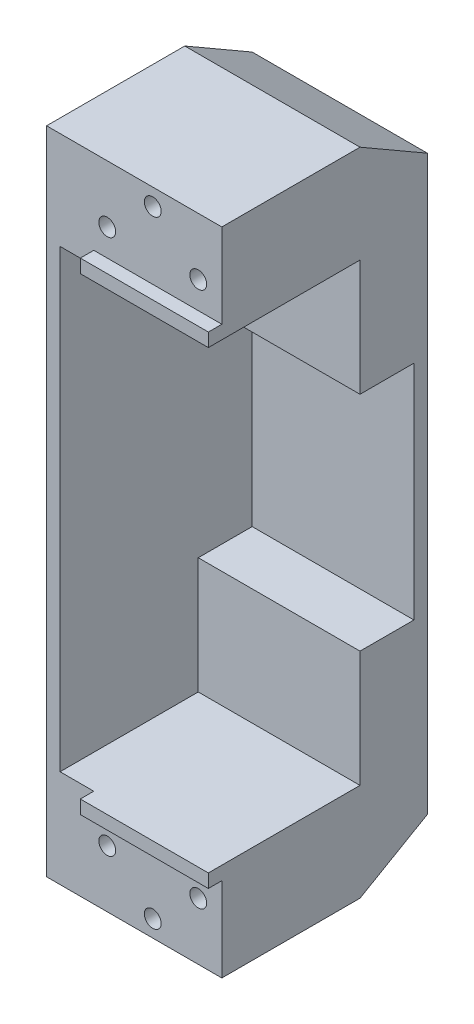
ISO-10303-21;
HEADER;
FILE_DESCRIPTION(('STEP AP214'),'2;1');
FILE_NAME('part.step','',(''),(''),'','','');
FILE_SCHEMA(('AUTOMOTIVE_DESIGN { 1 0 10303 214 1 1 1 1 }'));
ENDSEC;
DATA;
#1=APPLICATION_CONTEXT('core data for automotive mechanical design processes');
#2=APPLICATION_PROTOCOL_DEFINITION('international standard','automotive_design',2000,#1);
#3=PRODUCT_CONTEXT('',#1,'mechanical');
#4=PRODUCT('Part','Part','',(#3));
#5=PRODUCT_RELATED_PRODUCT_CATEGORY('part','',(#4));
#6=PRODUCT_DEFINITION_FORMATION('','',#4);
#7=PRODUCT_DEFINITION_CONTEXT('part definition',#1,'design');
#8=PRODUCT_DEFINITION('design','',#6,#7);
#9=PRODUCT_DEFINITION_SHAPE('','',#8);
#10=(LENGTH_UNIT() NAMED_UNIT(*) SI_UNIT(.MILLI.,.METRE.));
#11=(NAMED_UNIT(*) PLANE_ANGLE_UNIT() SI_UNIT($,.RADIAN.));
#12=(NAMED_UNIT(*) SI_UNIT($,.STERADIAN.) SOLID_ANGLE_UNIT());
#13=UNCERTAINTY_MEASURE_WITH_UNIT(LENGTH_MEASURE(1.E-05),#10,'distance_accuracy_value','');
#14=(GEOMETRIC_REPRESENTATION_CONTEXT(3) GLOBAL_UNCERTAINTY_ASSIGNED_CONTEXT((#13)) GLOBAL_UNIT_ASSIGNED_CONTEXT((#10,
#11,#12)) REPRESENTATION_CONTEXT('',''));
#15=CARTESIAN_POINT('',(0.,0.,0.));
#16=DIRECTION('',(0.,0.,1.));
#17=DIRECTION('',(1.,0.,0.));
#18=AXIS2_PLACEMENT_3D('',#15,#16,#17);
#19=CARTESIAN_POINT('',(0.,-164.,-57.));
#20=DIRECTION('',(0.,0.,-1.));
#21=DIRECTION('',(-1.,0.,0.));
#22=AXIS2_PLACEMENT_3D('',#19,#20,#21);
#23=PLANE('',#22);
#24=DIRECTION('',(-1.,0.,0.));
#25=VECTOR('',#24,1.);
#26=CARTESIAN_POINT('',(0.,-129.5,-57.));
#27=LINE('',#26,#25);
#28=CARTESIAN_POINT('',(0.,-129.5,-57.));
#29=VERTEX_POINT('',#28);
#30=CARTESIAN_POINT('',(-48.,-129.5,-57.));
#31=VERTEX_POINT('',#30);
#32=EDGE_CURVE('E223',#29,#31,#27,.T.);
#33=ORIENTED_EDGE('',*,*,#32,.F.);
#34=DIRECTION('',(0.,1.,0.));
#35=VECTOR('',#34,1.);
#36=CARTESIAN_POINT('',(0.,-164.,-57.));
#37=LINE('',#36,#35);
#38=CARTESIAN_POINT('',(0.,-63.5,-57.));
#39=VERTEX_POINT('',#38);
#40=EDGE_CURVE('E203',#29,#39,#37,.T.);
#41=ORIENTED_EDGE('',*,*,#40,.T.);
#42=DIRECTION('',(-1.,0.,0.));
#43=VECTOR('',#42,1.);
#44=CARTESIAN_POINT('',(0.,-63.5,-57.));
#45=LINE('',#44,#43);
#46=CARTESIAN_POINT('',(-48.,-63.5,-57.));
#47=VERTEX_POINT('',#46);
#48=EDGE_CURVE('E373',#39,#47,#45,.T.);
#49=ORIENTED_EDGE('',*,*,#48,.T.);
#50=DIRECTION('',(0.,1.,0.));
#51=VECTOR('',#50,1.);
#52=CARTESIAN_POINT('',(-48.,-164.,-57.));
#53=LINE('',#52,#51);
#54=EDGE_CURVE('E289',#31,#47,#53,.T.);
#55=ORIENTED_EDGE('',*,*,#54,.F.);
#56=EDGE_LOOP('',(#33,#41,#49,#55));
#57=FACE_BOUND('',#56,.T.);
#58=ADVANCED_FACE('F42',(#57),#23,.F.);
#59=CARTESIAN_POINT('',(0.,-29.,0.));
#60=DIRECTION('',(0.,-1.,0.));
#61=DIRECTION('',(0.,0.,-1.));
#62=AXIS2_PLACEMENT_3D('',#59,#60,#61);
#63=PLANE('',#62);
#64=DIRECTION('',(1.,0.,0.));
#65=VECTOR('',#64,1.);
#66=CARTESIAN_POINT('',(-52.,-29.,0.));
#67=LINE('',#66,#65);
#68=CARTESIAN_POINT('',(-48.,-29.,0.));
#69=VERTEX_POINT('',#68);
#70=CARTESIAN_POINT('',(-38.,-29.,0.));
#71=VERTEX_POINT('',#70);
#72=EDGE_CURVE('E352',#69,#71,#67,.T.);
#73=ORIENTED_EDGE('',*,*,#72,.F.);
#74=DIRECTION('',(0.,0.,1.));
#75=VECTOR('',#74,1.);
#76=CARTESIAN_POINT('',(-48.,-29.,-57.));
#77=LINE('',#76,#75);
#78=CARTESIAN_POINT('',(-48.,-29.,-41.));
#79=VERTEX_POINT('',#78);
#80=EDGE_CURVE('E281',#79,#69,#77,.T.);
#81=ORIENTED_EDGE('',*,*,#80,.F.);
#82=DIRECTION('',(-1.,0.,0.));
#83=VECTOR('',#82,1.);
#84=CARTESIAN_POINT('',(-52.,-29.,-41.));
#85=LINE('',#84,#83);
#86=CARTESIAN_POINT('',(0.,-29.,-41.));
#87=VERTEX_POINT('',#86);
#88=EDGE_CURVE('E295',#87,#79,#85,.T.);
#89=ORIENTED_EDGE('',*,*,#88,.F.);
#90=DIRECTION('',(0.,0.,-1.));
#91=VECTOR('',#90,1.);
#92=CARTESIAN_POINT('',(0.,-29.,0.));
#93=LINE('',#92,#91);
#94=CARTESIAN_POINT('',(0.,-29.,4.));
#95=VERTEX_POINT('',#94);
#96=EDGE_CURVE('E349',#95,#87,#93,.T.);
#97=ORIENTED_EDGE('',*,*,#96,.F.);
#98=DIRECTION('',(1.,0.,0.));
#99=VECTOR('',#98,1.);
#100=CARTESIAN_POINT('',(0.,-29.,4.));
#101=LINE('',#100,#99);
#102=CARTESIAN_POINT('',(-38.,-29.,4.));
#103=VERTEX_POINT('',#102);
#104=EDGE_CURVE('E332',#103,#95,#101,.T.);
#105=ORIENTED_EDGE('',*,*,#104,.F.);
#106=DIRECTION('',(0.,0.,-1.));
#107=VECTOR('',#106,1.);
#108=CARTESIAN_POINT('',(-38.,-29.,4.));
#109=LINE('',#108,#107);
#110=EDGE_CURVE('E335',#103,#71,#109,.T.);
#111=ORIENTED_EDGE('',*,*,#110,.T.);
#112=EDGE_LOOP('',(#73,#81,#89,#97,#105,#111));
#113=FACE_BOUND('',#112,.T.);
#114=ADVANCED_FACE('F466',(#113),#63,.T.);
#115=CARTESIAN_POINT('',(-52.,-63.5,-41.));
#116=DIRECTION('',(0.,0.,-1.));
#117=DIRECTION('',(-1.,0.,0.));
#118=AXIS2_PLACEMENT_3D('',#115,#116,#117);
#119=PLANE('',#118);
#120=DIRECTION('',(0.,1.,0.));
#121=VECTOR('',#120,1.);
#122=CARTESIAN_POINT('',(-48.,-63.5,-41.));
#123=LINE('',#122,#121);
#124=CARTESIAN_POINT('',(-48.,-63.5,-41.));
#125=VERTEX_POINT('',#124);
#126=EDGE_CURVE('E292',#125,#79,#123,.T.);
#127=ORIENTED_EDGE('',*,*,#126,.F.);
#128=DIRECTION('',(-1.,0.,0.));
#129=VECTOR('',#128,1.);
#130=CARTESIAN_POINT('',(-52.,-63.5,-41.));
#131=LINE('',#130,#129);
#132=CARTESIAN_POINT('',(0.,-63.5,-41.));
#133=VERTEX_POINT('',#132);
#134=EDGE_CURVE('E298',#133,#125,#131,.T.);
#135=ORIENTED_EDGE('',*,*,#134,.F.);
#136=DIRECTION('',(0.,1.,0.));
#137=VECTOR('',#136,1.);
#138=CARTESIAN_POINT('',(0.,-63.5,-41.));
#139=LINE('',#138,#137);
#140=EDGE_CURVE('E300',#133,#87,#139,.T.);
#141=ORIENTED_EDGE('',*,*,#140,.T.);
#142=ORIENTED_EDGE('',*,*,#88,.T.);
#143=EDGE_LOOP('',(#127,#135,#141,#142));
#144=FACE_BOUND('',#143,.T.);
#145=ADVANCED_FACE('F428',(#144),#119,.F.);
#146=CARTESIAN_POINT('',(0.,-63.5,0.));
#147=DIRECTION('',(0.,1.,0.));
#148=DIRECTION('',(0.,0.,1.));
#149=AXIS2_PLACEMENT_3D('',#146,#147,#148);
#150=PLANE('',#149);
#151=ORIENTED_EDGE('',*,*,#48,.F.);
#152=DIRECTION('',(0.,0.,1.));
#153=VECTOR('',#152,1.);
#154=CARTESIAN_POINT('',(0.,-63.5,-61.));
#155=LINE('',#154,#153);
#156=EDGE_CURVE('E296',#39,#133,#155,.T.);
#157=ORIENTED_EDGE('',*,*,#156,.T.);
#158=ORIENTED_EDGE('',*,*,#134,.T.);
#159=DIRECTION('',(0.,0.,1.));
#160=VECTOR('',#159,1.);
#161=CARTESIAN_POINT('',(-48.,-63.5,0.));
#162=LINE('',#161,#160);
#163=EDGE_CURVE('E364',#47,#125,#162,.T.);
#164=ORIENTED_EDGE('',*,*,#163,.F.);
#165=EDGE_LOOP('',(#151,#157,#158,#164));
#166=FACE_BOUND('',#165,.T.);
#167=ADVANCED_FACE('F432',(#166),#150,.F.);
#168=CARTESIAN_POINT('',(0.,-29.,0.));
#169=DIRECTION('',(1.,0.,0.));
#170=DIRECTION('',(0.,0.,-1.));
#171=AXIS2_PLACEMENT_3D('',#168,#169,#170);
#172=PLANE('',#171);
#173=DIRECTION('',(0.,0.,-1.));
#174=VECTOR('',#173,1.);
#175=CARTESIAN_POINT('',(0.,-193.,0.));
#176=LINE('',#175,#174);
#177=CARTESIAN_POINT('',(0.,-193.,0.));
#178=VERTEX_POINT('',#177);
#179=CARTESIAN_POINT('',(0.,-193.,-40.9999999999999));
#180=VERTEX_POINT('',#179);
#181=EDGE_CURVE('E267',#178,#180,#176,.T.);
#182=ORIENTED_EDGE('',*,*,#181,.T.);
#183=DIRECTION('',(0.,0.499999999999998,-0.86602540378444));
#184=VECTOR('',#183,1.);
#185=CARTESIAN_POINT('',(0.,-169.753520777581,-81.2640831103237));
#186=LINE('',#185,#184);
#187=CARTESIAN_POINT('',(0.,-181.452994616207,-61.));
#188=VERTEX_POINT('',#187);
#189=EDGE_CURVE('E11',#180,#188,#186,.T.);
#190=ORIENTED_EDGE('',*,*,#189,.T.);
#191=DIRECTION('',(0.,1.,0.));
#192=VECTOR('',#191,1.);
#193=CARTESIAN_POINT('',(0.,-29.,-61.));
#194=LINE('',#193,#192);
#195=CARTESIAN_POINT('',(0.,-11.5470053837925,-61.));
#196=VERTEX_POINT('',#195);
#197=EDGE_CURVE('E355',#188,#196,#194,.T.);
#198=ORIENTED_EDGE('',*,*,#197,.T.);
#199=DIRECTION('',(0.,0.499999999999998,0.86602540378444));
#200=VECTOR('',#199,1.);
#201=CARTESIAN_POINT('',(0.,10.5035207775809,-22.8073683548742));
#202=LINE('',#201,#200);
#203=CARTESIAN_POINT('',(0.,0.,-40.9999999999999));
#204=VERTEX_POINT('',#203);
#205=EDGE_CURVE('E385',#196,#204,#202,.T.);
#206=ORIENTED_EDGE('',*,*,#205,.T.);
#207=DIRECTION('',(0.,0.,-1.));
#208=VECTOR('',#207,1.);
#209=CARTESIAN_POINT('',(0.,0.,0.));
#210=LINE('',#209,#208);
#211=CARTESIAN_POINT('',(0.,0.,0.));
#212=VERTEX_POINT('',#211);
#213=EDGE_CURVE('E348',#212,#204,#210,.T.);
#214=ORIENTED_EDGE('',*,*,#213,.F.);
#215=DIRECTION('',(0.,1.,0.));
#216=VECTOR('',#215,1.);
#217=CARTESIAN_POINT('',(0.,-29.,0.));
#218=LINE('',#217,#216);
#219=CARTESIAN_POINT('',(0.,-25.,0.));
#220=VERTEX_POINT('',#219);
#221=EDGE_CURVE('E362',#220,#212,#218,.T.);
#222=ORIENTED_EDGE('',*,*,#221,.F.);
#223=DIRECTION('',(0.,0.,-1.));
#224=VECTOR('',#223,1.);
#225=CARTESIAN_POINT('',(0.,-25.,4.));
#226=LINE('',#225,#224);
#227=CARTESIAN_POINT('',(0.,-25.,4.));
#228=VERTEX_POINT('',#227);
#229=EDGE_CURVE('E345',#228,#220,#226,.T.);
#230=ORIENTED_EDGE('',*,*,#229,.F.);
#231=DIRECTION('',(0.,1.,0.));
#232=VECTOR('',#231,1.);
#233=CARTESIAN_POINT('',(0.,-29.,4.));
#234=LINE('',#233,#232);
#235=EDGE_CURVE('E324',#95,#228,#234,.T.);
#236=ORIENTED_EDGE('',*,*,#235,.F.);
#237=ORIENTED_EDGE('',*,*,#96,.T.);
#238=ORIENTED_EDGE('',*,*,#140,.F.);
#239=ORIENTED_EDGE('',*,*,#156,.F.);
#240=ORIENTED_EDGE('',*,*,#40,.F.);
#241=DIRECTION('',(0.,0.,1.));
#242=VECTOR('',#241,1.);
#243=CARTESIAN_POINT('',(0.,-129.5,-61.));
#244=LINE('',#243,#242);
#245=CARTESIAN_POINT('',(0.,-129.5,-41.));
#246=VERTEX_POINT('',#245);
#247=EDGE_CURVE('E197',#29,#246,#244,.T.);
#248=ORIENTED_EDGE('',*,*,#247,.T.);
#249=DIRECTION('',(0.,-1.,0.));
#250=VECTOR('',#249,1.);
#251=CARTESIAN_POINT('',(0.,-129.5,-41.));
#252=LINE('',#251,#250);
#253=CARTESIAN_POINT('',(0.,-164.,-41.));
#254=VERTEX_POINT('',#253);
#255=EDGE_CURVE('E200',#246,#254,#252,.T.);
#256=ORIENTED_EDGE('',*,*,#255,.T.);
#257=DIRECTION('',(0.,0.,-1.));
#258=VECTOR('',#257,1.);
#259=CARTESIAN_POINT('',(0.,-164.,0.));
#260=LINE('',#259,#258);
#261=CARTESIAN_POINT('',(0.,-164.,4.));
#262=VERTEX_POINT('',#261);
#263=EDGE_CURVE('E268',#262,#254,#260,.T.);
#264=ORIENTED_EDGE('',*,*,#263,.F.);
#265=DIRECTION('',(0.,-1.,0.));
#266=VECTOR('',#265,1.);
#267=CARTESIAN_POINT('',(0.,-164.,4.));
#268=LINE('',#267,#266);
#269=CARTESIAN_POINT('',(0.,-168.,4.));
#270=VERTEX_POINT('',#269);
#271=EDGE_CURVE('E244',#262,#270,#268,.T.);
#272=ORIENTED_EDGE('',*,*,#271,.T.);
#273=DIRECTION('',(0.,0.,-1.));
#274=VECTOR('',#273,1.);
#275=CARTESIAN_POINT('',(0.,-168.,4.));
#276=LINE('',#275,#274);
#277=CARTESIAN_POINT('',(0.,-168.,0.));
#278=VERTEX_POINT('',#277);
#279=EDGE_CURVE('E257',#270,#278,#276,.T.);
#280=ORIENTED_EDGE('',*,*,#279,.T.);
#281=DIRECTION('',(0.,-1.,0.));
#282=VECTOR('',#281,1.);
#283=CARTESIAN_POINT('',(0.,-164.,0.));
#284=LINE('',#283,#282);
#285=EDGE_CURVE('E274',#278,#178,#284,.T.);
#286=ORIENTED_EDGE('',*,*,#285,.T.);
#287=EDGE_LOOP('',(#182,#190,#198,#206,#214,#222,#230,#236,#237,#238,#239,#240,#248,#256,#264,
#272,#280,#286));
#288=FACE_BOUND('',#287,.T.);
#289=ADVANCED_FACE('F199',(#288),#172,.T.);
#290=CARTESIAN_POINT('',(-52.,-29.,0.));
#291=DIRECTION('',(0.,0.,1.));
#292=DIRECTION('',(1.,0.,0.));
#293=AXIS2_PLACEMENT_3D('',#290,#291,#292);
#294=PLANE('',#293);
#295=CARTESIAN_POINT('',(-34.,-176.,0.));
#296=DIRECTION('',(0.,0.,1.));
#297=DIRECTION('',(1.,0.,0.));
#298=AXIS2_PLACEMENT_3D('',#295,#296,#297);
#299=CIRCLE('',#298,2.49999999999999);
#300=CARTESIAN_POINT('',(-31.5,-176.,0.));
#301=VERTEX_POINT('',#300);
#302=EDGE_CURVE('E225',#301,#301,#299,.T.);
#303=ORIENTED_EDGE('',*,*,#302,.F.);
#304=EDGE_LOOP('',(#303));
#305=FACE_BOUND('',#304,.T.);
#306=CARTESIAN_POINT('',(-7.,-176.,0.));
#307=DIRECTION('',(0.,0.,1.));
#308=DIRECTION('',(1.,0.,0.));
#309=AXIS2_PLACEMENT_3D('',#306,#307,#308);
#310=CIRCLE('',#309,2.49999999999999);
#311=CARTESIAN_POINT('',(-4.50000000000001,-176.,0.));
#312=VERTEX_POINT('',#311);
#313=EDGE_CURVE('E231',#312,#312,#310,.T.);
#314=ORIENTED_EDGE('',*,*,#313,.F.);
#315=EDGE_LOOP('',(#314));
#316=FACE_BOUND('',#315,.T.);
#317=CARTESIAN_POINT('',(-20.5,-188.,0.));
#318=DIRECTION('',(0.,0.,1.));
#319=DIRECTION('',(1.,0.,0.));
#320=AXIS2_PLACEMENT_3D('',#317,#318,#319);
#321=CIRCLE('',#320,2.49999999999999);
#322=CARTESIAN_POINT('',(-18.,-188.,0.));
#323=VERTEX_POINT('',#322);
#324=EDGE_CURVE('E237',#323,#323,#321,.T.);
#325=ORIENTED_EDGE('',*,*,#324,.F.);
#326=EDGE_LOOP('',(#325));
#327=FACE_BOUND('',#326,.T.);
#328=DIRECTION('',(0.,1.,0.));
#329=VECTOR('',#328,1.);
#330=CARTESIAN_POINT('',(-38.,-164.,0.));
#331=LINE('',#330,#329);
#332=CARTESIAN_POINT('',(-38.,-168.,0.));
#333=VERTEX_POINT('',#332);
#334=CARTESIAN_POINT('',(-38.,-164.,0.));
#335=VERTEX_POINT('',#334);
#336=EDGE_CURVE('E243',#333,#335,#331,.T.);
#337=ORIENTED_EDGE('',*,*,#336,.T.);
#338=DIRECTION('',(1.,0.,0.));
#339=VECTOR('',#338,1.);
#340=CARTESIAN_POINT('',(-52.,-164.,0.));
#341=LINE('',#340,#339);
#342=CARTESIAN_POINT('',(-48.,-164.,0.));
#343=VERTEX_POINT('',#342);
#344=EDGE_CURVE('E270',#343,#335,#341,.T.);
#345=ORIENTED_EDGE('',*,*,#344,.F.);
#346=DIRECTION('',(0.,1.,0.));
#347=VECTOR('',#346,1.);
#348=CARTESIAN_POINT('',(-48.,-164.,0.));
#349=LINE('',#348,#347);
#350=EDGE_CURVE('E284',#343,#69,#349,.T.);
#351=ORIENTED_EDGE('',*,*,#350,.T.);
#352=ORIENTED_EDGE('',*,*,#72,.T.);
#353=DIRECTION('',(0.,-1.,0.));
#354=VECTOR('',#353,1.);
#355=CARTESIAN_POINT('',(-38.,-29.,0.));
#356=LINE('',#355,#354);
#357=CARTESIAN_POINT('',(-38.,-25.,0.));
#358=VERTEX_POINT('',#357);
#359=EDGE_CURVE('E328',#358,#71,#356,.T.);
#360=ORIENTED_EDGE('',*,*,#359,.F.);
#361=DIRECTION('',(-1.,0.,0.));
#362=VECTOR('',#361,1.);
#363=CARTESIAN_POINT('',(0.,-25.,0.));
#364=LINE('',#363,#362);
#365=EDGE_CURVE('E323',#220,#358,#364,.T.);
#366=ORIENTED_EDGE('',*,*,#365,.F.);
#367=ORIENTED_EDGE('',*,*,#221,.T.);
#368=DIRECTION('',(1.,0.,0.));
#369=VECTOR('',#368,1.);
#370=CARTESIAN_POINT('',(-52.,0.,0.));
#371=LINE('',#370,#369);
#372=CARTESIAN_POINT('',(-52.,0.,0.));
#373=VERTEX_POINT('',#372);
#374=EDGE_CURVE('E353',#373,#212,#371,.T.);
#375=ORIENTED_EDGE('',*,*,#374,.F.);
#376=DIRECTION('',(0.,1.,0.));
#377=VECTOR('',#376,1.);
#378=CARTESIAN_POINT('',(-52.,-29.,0.));
#379=LINE('',#378,#377);
#380=CARTESIAN_POINT('',(-52.,-193.,0.));
#381=VERTEX_POINT('',#380);
#382=EDGE_CURVE('E365',#381,#373,#379,.T.);
#383=ORIENTED_EDGE('',*,*,#382,.F.);
#384=DIRECTION('',(1.,0.,0.));
#385=VECTOR('',#384,1.);
#386=CARTESIAN_POINT('',(-52.,-193.,0.));
#387=LINE('',#386,#385);
#388=EDGE_CURVE('E276',#381,#178,#387,.T.);
#389=ORIENTED_EDGE('',*,*,#388,.T.);
#390=ORIENTED_EDGE('',*,*,#285,.F.);
#391=DIRECTION('',(-1.,0.,0.));
#392=VECTOR('',#391,1.);
#393=CARTESIAN_POINT('',(0.,-168.,0.));
#394=LINE('',#393,#392);
#395=EDGE_CURVE('E248',#278,#333,#394,.T.);
#396=ORIENTED_EDGE('',*,*,#395,.T.);
#397=EDGE_LOOP('',(#337,#345,#351,#352,#360,#366,#367,#375,#383,#389,#390,#396));
#398=FACE_BOUND('',#397,.T.);
#399=CARTESIAN_POINT('',(-34.,-17.,0.));
#400=DIRECTION('',(0.,0.,1.));
#401=DIRECTION('',(1.,0.,0.));
#402=AXIS2_PLACEMENT_3D('',#399,#400,#401);
#403=CIRCLE('',#402,2.49999999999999);
#404=CARTESIAN_POINT('',(-31.5,-17.,0.));
#405=VERTEX_POINT('',#404);
#406=EDGE_CURVE('E305',#405,#405,#403,.T.);
#407=ORIENTED_EDGE('',*,*,#406,.F.);
#408=EDGE_LOOP('',(#407));
#409=FACE_BOUND('',#408,.T.);
#410=CARTESIAN_POINT('',(-7.,-17.,0.));
#411=DIRECTION('',(0.,0.,1.));
#412=DIRECTION('',(1.,0.,0.));
#413=AXIS2_PLACEMENT_3D('',#410,#411,#412);
#414=CIRCLE('',#413,2.49999999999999);
#415=CARTESIAN_POINT('',(-4.50000000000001,-17.,0.));
#416=VERTEX_POINT('',#415);
#417=EDGE_CURVE('E311',#416,#416,#414,.T.);
#418=ORIENTED_EDGE('',*,*,#417,.F.);
#419=EDGE_LOOP('',(#418));
#420=FACE_BOUND('',#419,.T.);
#421=CARTESIAN_POINT('',(-20.5,-5.,0.));
#422=DIRECTION('',(0.,0.,1.));
#423=DIRECTION('',(1.,0.,0.));
#424=AXIS2_PLACEMENT_3D('',#421,#422,#423);
#425=CIRCLE('',#424,2.49999999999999);
#426=CARTESIAN_POINT('',(-18.,-5.,0.));
#427=VERTEX_POINT('',#426);
#428=EDGE_CURVE('E317',#427,#427,#425,.T.);
#429=ORIENTED_EDGE('',*,*,#428,.F.);
#430=EDGE_LOOP('',(#429));
#431=FACE_BOUND('',#430,.T.);
#432=ADVANCED_FACE('F411',(#305,#316,#327,#398,#409,#420,#431),#294,.T.);
#433=CARTESIAN_POINT('',(-52.,-29.,0.));
#434=DIRECTION('',(-1.,0.,0.));
#435=DIRECTION('',(0.,0.,1.));
#436=AXIS2_PLACEMENT_3D('',#433,#434,#435);
#437=PLANE('',#436);
#438=DIRECTION('',(0.,1.,0.));
#439=VECTOR('',#438,1.);
#440=CARTESIAN_POINT('',(-52.,-29.,-61.));
#441=LINE('',#440,#439);
#442=CARTESIAN_POINT('',(-52.,-181.452994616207,-61.));
#443=VERTEX_POINT('',#442);
#444=CARTESIAN_POINT('',(-52.,-11.5470053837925,-61.));
#445=VERTEX_POINT('',#444);
#446=EDGE_CURVE('E368',#443,#445,#441,.T.);
#447=ORIENTED_EDGE('',*,*,#446,.F.);
#448=DIRECTION('',(0.,-0.499999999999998,0.86602540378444));
#449=VECTOR('',#448,1.);
#450=CARTESIAN_POINT('',(-52.,-169.753520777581,-81.2640831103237));
#451=LINE('',#450,#449);
#452=CARTESIAN_POINT('',(-52.,-193.,-40.9999999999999));
#453=VERTEX_POINT('',#452);
#454=EDGE_CURVE('E64',#443,#453,#451,.T.);
#455=ORIENTED_EDGE('',*,*,#454,.T.);
#456=DIRECTION('',(0.,0.,1.));
#457=VECTOR('',#456,1.);
#458=CARTESIAN_POINT('',(-52.,-193.,0.));
#459=LINE('',#458,#457);
#460=EDGE_CURVE('E271',#453,#381,#459,.T.);
#461=ORIENTED_EDGE('',*,*,#460,.T.);
#462=ORIENTED_EDGE('',*,*,#382,.T.);
#463=DIRECTION('',(0.,0.,1.));
#464=VECTOR('',#463,1.);
#465=CARTESIAN_POINT('',(-52.,0.,0.));
#466=LINE('',#465,#464);
#467=CARTESIAN_POINT('',(-52.,0.,-40.9999999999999));
#468=VERTEX_POINT('',#467);
#469=EDGE_CURVE('E358',#468,#373,#466,.T.);
#470=ORIENTED_EDGE('',*,*,#469,.F.);
#471=DIRECTION('',(0.,-0.499999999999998,-0.86602540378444));
#472=VECTOR('',#471,1.);
#473=CARTESIAN_POINT('',(-52.,10.5035207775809,-22.8073683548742));
#474=LINE('',#473,#472);
#475=EDGE_CURVE('E379',#468,#445,#474,.T.);
#476=ORIENTED_EDGE('',*,*,#475,.T.);
#477=EDGE_LOOP('',(#447,#455,#461,#462,#470,#476));
#478=FACE_BOUND('',#477,.T.);
#479=ADVANCED_FACE('F397',(#478),#437,.T.);
#480=CARTESIAN_POINT('',(-52.,-29.,-61.));
#481=DIRECTION('',(0.,0.,-1.));
#482=DIRECTION('',(-1.,0.,0.));
#483=AXIS2_PLACEMENT_3D('',#480,#481,#482);
#484=PLANE('',#483);
#485=ORIENTED_EDGE('',*,*,#197,.F.);
#486=DIRECTION('',(-1.,0.,0.));
#487=VECTOR('',#486,1.);
#488=CARTESIAN_POINT('',(-52.,-181.452994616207,-61.));
#489=LINE('',#488,#487);
#490=EDGE_CURVE('E388',#188,#443,#489,.T.);
#491=ORIENTED_EDGE('',*,*,#490,.T.);
#492=ORIENTED_EDGE('',*,*,#446,.T.);
#493=DIRECTION('',(1.,0.,0.));
#494=VECTOR('',#493,1.);
#495=CARTESIAN_POINT('',(0.,-11.5470053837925,-61.));
#496=LINE('',#495,#494);
#497=EDGE_CURVE('E382',#445,#196,#496,.T.);
#498=ORIENTED_EDGE('',*,*,#497,.T.);
#499=EDGE_LOOP('',(#485,#491,#492,#498));
#500=FACE_BOUND('',#499,.T.);
#501=ADVANCED_FACE('F394',(#500),#484,.T.);
#502=CARTESIAN_POINT('',(0.,0.,0.));
#503=DIRECTION('',(0.,-1.,0.));
#504=DIRECTION('',(0.,0.,-1.));
#505=AXIS2_PLACEMENT_3D('',#502,#503,#504);
#506=PLANE('',#505);
#507=ORIENTED_EDGE('',*,*,#213,.T.);
#508=DIRECTION('',(-1.,0.,0.));
#509=VECTOR('',#508,1.);
#510=CARTESIAN_POINT('',(-52.,0.,-40.9999999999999));
#511=LINE('',#510,#509);
#512=EDGE_CURVE('E376',#204,#468,#511,.T.);
#513=ORIENTED_EDGE('',*,*,#512,.T.);
#514=ORIENTED_EDGE('',*,*,#469,.T.);
#515=ORIENTED_EDGE('',*,*,#374,.T.);
#516=EDGE_LOOP('',(#507,#513,#514,#515));
#517=FACE_BOUND('',#516,.T.);
#518=ADVANCED_FACE('F407',(#517),#506,.F.);
#519=CARTESIAN_POINT('',(0.,-25.,4.));
#520=DIRECTION('',(0.,-1.,0.));
#521=DIRECTION('',(1.,0.,0.));
#522=AXIS2_PLACEMENT_3D('',#519,#520,#521);
#523=PLANE('',#522);
#524=ORIENTED_EDGE('',*,*,#365,.T.);
#525=DIRECTION('',(0.,0.,-1.));
#526=VECTOR('',#525,1.);
#527=CARTESIAN_POINT('',(-38.,-25.,4.));
#528=LINE('',#527,#526);
#529=CARTESIAN_POINT('',(-38.,-25.,4.));
#530=VERTEX_POINT('',#529);
#531=EDGE_CURVE('E342',#530,#358,#528,.T.);
#532=ORIENTED_EDGE('',*,*,#531,.F.);
#533=DIRECTION('',(-1.,0.,0.));
#534=VECTOR('',#533,1.);
#535=CARTESIAN_POINT('',(0.,-25.,4.));
#536=LINE('',#535,#534);
#537=EDGE_CURVE('E327',#228,#530,#536,.T.);
#538=ORIENTED_EDGE('',*,*,#537,.F.);
#539=ORIENTED_EDGE('',*,*,#229,.T.);
#540=EDGE_LOOP('',(#524,#532,#538,#539));
#541=FACE_BOUND('',#540,.T.);
#542=ADVANCED_FACE('F417',(#541),#523,.F.);
#543=CARTESIAN_POINT('',(-38.,-29.,4.));
#544=DIRECTION('',(1.,0.,0.));
#545=DIRECTION('',(0.,0.,-1.));
#546=AXIS2_PLACEMENT_3D('',#543,#544,#545);
#547=PLANE('',#546);
#548=ORIENTED_EDGE('',*,*,#359,.T.);
#549=ORIENTED_EDGE('',*,*,#110,.F.);
#550=DIRECTION('',(0.,-1.,0.));
#551=VECTOR('',#550,1.);
#552=CARTESIAN_POINT('',(-38.,-29.,4.));
#553=LINE('',#552,#551);
#554=EDGE_CURVE('E330',#530,#103,#553,.T.);
#555=ORIENTED_EDGE('',*,*,#554,.F.);
#556=ORIENTED_EDGE('',*,*,#531,.T.);
#557=EDGE_LOOP('',(#548,#549,#555,#556));
#558=FACE_BOUND('',#557,.T.);
#559=ADVANCED_FACE('F503',(#558),#547,.F.);
#560=CARTESIAN_POINT('',(0.,0.,4.));
#561=DIRECTION('',(0.,0.,1.));
#562=DIRECTION('',(1.,0.,0.));
#563=AXIS2_PLACEMENT_3D('',#560,#561,#562);
#564=PLANE('',#563);
#565=ORIENTED_EDGE('',*,*,#235,.T.);
#566=ORIENTED_EDGE('',*,*,#537,.T.);
#567=ORIENTED_EDGE('',*,*,#554,.T.);
#568=ORIENTED_EDGE('',*,*,#104,.T.);
#569=EDGE_LOOP('',(#565,#566,#567,#568));
#570=FACE_BOUND('',#569,.T.);
#571=ADVANCED_FACE('F421',(#570),#564,.T.);
#572=CARTESIAN_POINT('',(-20.5,-5.,-20.));
#573=DIRECTION('',(0.,0.,1.));
#574=DIRECTION('',(1.,0.,0.));
#575=AXIS2_PLACEMENT_3D('',#572,#573,#574);
#576=CONICAL_SURFACE('',#575,2.49999999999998,1.02974425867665);
#577=CARTESIAN_POINT('',(-20.5,-5.,-21.5021515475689));
#578=VERTEX_POINT('',#577);
#579=VERTEX_LOOP('',#578);
#580=FACE_BOUND('',#579,.T.);
#581=CARTESIAN_POINT('',(-20.5,-5.,-20.));
#582=DIRECTION('',(0.,0.,1.));
#583=DIRECTION('',(1.,0.,0.));
#584=AXIS2_PLACEMENT_3D('',#581,#582,#583);
#585=CIRCLE('',#584,2.49999999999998);
#586=CARTESIAN_POINT('',(-18.,-5.,-20.));
#587=VERTEX_POINT('',#586);
#588=EDGE_CURVE('E320',#587,#587,#585,.T.);
#589=ORIENTED_EDGE('',*,*,#588,.T.);
#590=EDGE_LOOP('',(#589));
#591=FACE_BOUND('',#590,.T.);
#592=ADVANCED_FACE('F496',(#580,#591),#576,.F.);
#593=CARTESIAN_POINT('',(-20.5,-5.,0.));
#594=DIRECTION('',(0.,0.,1.));
#595=DIRECTION('',(1.,0.,0.));
#596=AXIS2_PLACEMENT_3D('',#593,#594,#595);
#597=CYLINDRICAL_SURFACE('',#596,2.49999999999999);
#598=ORIENTED_EDGE('',*,*,#588,.F.);
#599=EDGE_LOOP('',(#598));
#600=FACE_BOUND('',#599,.T.);
#601=ORIENTED_EDGE('',*,*,#428,.T.);
#602=EDGE_LOOP('',(#601));
#603=FACE_BOUND('',#602,.T.);
#604=ADVANCED_FACE('F492',(#600,#603),#597,.F.);
#605=CARTESIAN_POINT('',(-7.,-17.,-20.));
#606=DIRECTION('',(0.,0.,1.));
#607=DIRECTION('',(1.,0.,0.));
#608=AXIS2_PLACEMENT_3D('',#605,#606,#607);
#609=CONICAL_SURFACE('',#608,2.49999999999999,1.02974425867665);
#610=CARTESIAN_POINT('',(-7.00000000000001,-17.,-21.5021515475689));
#611=VERTEX_POINT('',#610);
#612=VERTEX_LOOP('',#611);
#613=FACE_BOUND('',#612,.T.);
#614=CARTESIAN_POINT('',(-7.,-17.,-20.));
#615=DIRECTION('',(0.,0.,1.));
#616=DIRECTION('',(1.,0.,0.));
#617=AXIS2_PLACEMENT_3D('',#614,#615,#616);
#618=CIRCLE('',#617,2.49999999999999);
#619=CARTESIAN_POINT('',(-4.50000000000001,-17.,-20.));
#620=VERTEX_POINT('',#619);
#621=EDGE_CURVE('E314',#620,#620,#618,.T.);
#622=ORIENTED_EDGE('',*,*,#621,.T.);
#623=EDGE_LOOP('',(#622));
#624=FACE_BOUND('',#623,.T.);
#625=ADVANCED_FACE('F488',(#613,#624),#609,.F.);
#626=CARTESIAN_POINT('',(-7.,-17.,0.));
#627=DIRECTION('',(0.,0.,1.));
#628=DIRECTION('',(1.,0.,0.));
#629=AXIS2_PLACEMENT_3D('',#626,#627,#628);
#630=CYLINDRICAL_SURFACE('',#629,2.49999999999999);
#631=ORIENTED_EDGE('',*,*,#621,.F.);
#632=EDGE_LOOP('',(#631));
#633=FACE_BOUND('',#632,.T.);
#634=ORIENTED_EDGE('',*,*,#417,.T.);
#635=EDGE_LOOP('',(#634));
#636=FACE_BOUND('',#635,.T.);
#637=ADVANCED_FACE('F484',(#633,#636),#630,.F.);
#638=CARTESIAN_POINT('',(-34.,-17.,-20.));
#639=DIRECTION('',(0.,0.,1.));
#640=DIRECTION('',(1.,0.,0.));
#641=AXIS2_PLACEMENT_3D('',#638,#639,#640);
#642=CONICAL_SURFACE('',#641,2.49999999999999,1.02974425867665);
#643=CARTESIAN_POINT('',(-34.,-17.,-21.5021515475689));
#644=VERTEX_POINT('',#643);
#645=VERTEX_LOOP('',#644);
#646=FACE_BOUND('',#645,.T.);
#647=CARTESIAN_POINT('',(-34.,-17.,-20.));
#648=DIRECTION('',(0.,0.,1.));
#649=DIRECTION('',(1.,0.,0.));
#650=AXIS2_PLACEMENT_3D('',#647,#648,#649);
#651=CIRCLE('',#650,2.49999999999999);
#652=CARTESIAN_POINT('',(-31.5,-17.,-20.));
#653=VERTEX_POINT('',#652);
#654=EDGE_CURVE('E308',#653,#653,#651,.T.);
#655=ORIENTED_EDGE('',*,*,#654,.T.);
#656=EDGE_LOOP('',(#655));
#657=FACE_BOUND('',#656,.T.);
#658=ADVANCED_FACE('F480',(#646,#657),#642,.F.);
#659=CARTESIAN_POINT('',(-34.,-17.,0.));
#660=DIRECTION('',(0.,0.,1.));
#661=DIRECTION('',(1.,0.,0.));
#662=AXIS2_PLACEMENT_3D('',#659,#660,#661);
#663=CYLINDRICAL_SURFACE('',#662,2.49999999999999);
#664=ORIENTED_EDGE('',*,*,#654,.F.);
#665=EDGE_LOOP('',(#664));
#666=FACE_BOUND('',#665,.T.);
#667=ORIENTED_EDGE('',*,*,#406,.T.);
#668=EDGE_LOOP('',(#667));
#669=FACE_BOUND('',#668,.T.);
#670=ADVANCED_FACE('F477',(#666,#669),#663,.F.);
#671=CARTESIAN_POINT('',(-48.,-164.,-57.));
#672=DIRECTION('',(-1.,0.,0.));
#673=DIRECTION('',(0.,0.,1.));
#674=AXIS2_PLACEMENT_3D('',#671,#672,#673);
#675=PLANE('',#674);
#676=DIRECTION('',(0.,0.,1.));
#677=VECTOR('',#676,1.);
#678=CARTESIAN_POINT('',(-48.,-164.,-57.));
#679=LINE('',#678,#677);
#680=CARTESIAN_POINT('',(-48.,-164.,-41.));
#681=VERTEX_POINT('',#680);
#682=EDGE_CURVE('E282',#681,#343,#679,.T.);
#683=ORIENTED_EDGE('',*,*,#682,.F.);
#684=DIRECTION('',(0.,1.,0.));
#685=VECTOR('',#684,1.);
#686=CARTESIAN_POINT('',(-48.,-164.,-41.));
#687=LINE('',#686,#685);
#688=CARTESIAN_POINT('',(-48.,-129.5,-41.));
#689=VERTEX_POINT('',#688);
#690=EDGE_CURVE('E214',#681,#689,#687,.T.);
#691=ORIENTED_EDGE('',*,*,#690,.T.);
#692=DIRECTION('',(0.,0.,1.));
#693=VECTOR('',#692,1.);
#694=CARTESIAN_POINT('',(-48.,-129.5,-57.));
#695=LINE('',#694,#693);
#696=EDGE_CURVE('E218',#31,#689,#695,.T.);
#697=ORIENTED_EDGE('',*,*,#696,.F.);
#698=ORIENTED_EDGE('',*,*,#54,.T.);
#699=ORIENTED_EDGE('',*,*,#163,.T.);
#700=ORIENTED_EDGE('',*,*,#126,.T.);
#701=ORIENTED_EDGE('',*,*,#80,.T.);
#702=ORIENTED_EDGE('',*,*,#350,.F.);
#703=EDGE_LOOP('',(#683,#691,#697,#698,#699,#700,#701,#702));
#704=FACE_BOUND('',#703,.T.);
#705=ADVANCED_FACE('F437',(#704),#675,.F.);
#706=CARTESIAN_POINT('',(0.,0.,-40.9999999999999));
#707=DIRECTION('',(0.,0.86602540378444,-0.499999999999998));
#708=DIRECTION('',(1.,0.,0.));
#709=AXIS2_PLACEMENT_3D('',#706,#707,#708);
#710=PLANE('',#709);
#711=ORIENTED_EDGE('',*,*,#205,.F.);
#712=ORIENTED_EDGE('',*,*,#497,.F.);
#713=ORIENTED_EDGE('',*,*,#475,.F.);
#714=ORIENTED_EDGE('',*,*,#512,.F.);
#715=EDGE_LOOP('',(#711,#712,#713,#714));
#716=FACE_BOUND('',#715,.T.);
#717=ADVANCED_FACE('F403',(#716),#710,.T.);
#718=CARTESIAN_POINT('',(0.,-164.,0.));
#719=DIRECTION('',(0.,1.,0.));
#720=DIRECTION('',(0.,0.,-1.));
#721=AXIS2_PLACEMENT_3D('',#718,#719,#720);
#722=PLANE('',#721);
#723=DIRECTION('',(-1.,0.,0.));
#724=VECTOR('',#723,1.);
#725=CARTESIAN_POINT('',(-52.,-164.,-41.));
#726=LINE('',#725,#724);
#727=EDGE_CURVE('E213',#254,#681,#726,.T.);
#728=ORIENTED_EDGE('',*,*,#727,.T.);
#729=ORIENTED_EDGE('',*,*,#682,.T.);
#730=ORIENTED_EDGE('',*,*,#344,.T.);
#731=DIRECTION('',(0.,0.,-1.));
#732=VECTOR('',#731,1.);
#733=CARTESIAN_POINT('',(-38.,-164.,4.));
#734=LINE('',#733,#732);
#735=CARTESIAN_POINT('',(-38.,-164.,4.));
#736=VERTEX_POINT('',#735);
#737=EDGE_CURVE('E265',#736,#335,#734,.T.);
#738=ORIENTED_EDGE('',*,*,#737,.F.);
#739=DIRECTION('',(1.,0.,0.));
#740=VECTOR('',#739,1.);
#741=CARTESIAN_POINT('',(0.,-164.,4.));
#742=LINE('',#741,#740);
#743=EDGE_CURVE('E247',#736,#262,#742,.T.);
#744=ORIENTED_EDGE('',*,*,#743,.T.);
#745=ORIENTED_EDGE('',*,*,#263,.T.);
#746=EDGE_LOOP('',(#728,#729,#730,#738,#744,#745));
#747=FACE_BOUND('',#746,.T.);
#748=ADVANCED_FACE('F441',(#747),#722,.T.);
#749=CARTESIAN_POINT('',(0.,-193.,0.));
#750=DIRECTION('',(0.,1.,0.));
#751=DIRECTION('',(0.,0.,-1.));
#752=AXIS2_PLACEMENT_3D('',#749,#750,#751);
#753=PLANE('',#752);
#754=ORIENTED_EDGE('',*,*,#460,.F.);
#755=DIRECTION('',(1.,0.,0.));
#756=VECTOR('',#755,1.);
#757=CARTESIAN_POINT('',(0.,-193.,-40.9999999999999));
#758=LINE('',#757,#756);
#759=EDGE_CURVE('E50',#453,#180,#758,.T.);
#760=ORIENTED_EDGE('',*,*,#759,.T.);
#761=ORIENTED_EDGE('',*,*,#181,.F.);
#762=ORIENTED_EDGE('',*,*,#388,.F.);
#763=EDGE_LOOP('',(#754,#760,#761,#762));
#764=FACE_BOUND('',#763,.T.);
#765=ADVANCED_FACE('F453',(#764),#753,.F.);
#766=CARTESIAN_POINT('',(-38.,-164.,4.));
#767=DIRECTION('',(-1.,0.,0.));
#768=DIRECTION('',(0.,0.,1.));
#769=AXIS2_PLACEMENT_3D('',#766,#767,#768);
#770=PLANE('',#769);
#771=ORIENTED_EDGE('',*,*,#336,.F.);
#772=DIRECTION('',(0.,0.,-1.));
#773=VECTOR('',#772,1.);
#774=CARTESIAN_POINT('',(-38.,-168.,4.));
#775=LINE('',#774,#773);
#776=CARTESIAN_POINT('',(-38.,-168.,4.));
#777=VERTEX_POINT('',#776);
#778=EDGE_CURVE('E263',#777,#333,#775,.T.);
#779=ORIENTED_EDGE('',*,*,#778,.F.);
#780=DIRECTION('',(0.,1.,0.));
#781=VECTOR('',#780,1.);
#782=CARTESIAN_POINT('',(-38.,-164.,4.));
#783=LINE('',#782,#781);
#784=EDGE_CURVE('E251',#777,#736,#783,.T.);
#785=ORIENTED_EDGE('',*,*,#784,.T.);
#786=ORIENTED_EDGE('',*,*,#737,.T.);
#787=EDGE_LOOP('',(#771,#779,#785,#786));
#788=FACE_BOUND('',#787,.T.);
#789=ADVANCED_FACE('F455',(#788),#770,.T.);
#790=CARTESIAN_POINT('',(0.,-168.,4.));
#791=DIRECTION('',(0.,-1.,0.));
#792=DIRECTION('',(1.,0.,0.));
#793=AXIS2_PLACEMENT_3D('',#790,#791,#792);
#794=PLANE('',#793);
#795=ORIENTED_EDGE('',*,*,#395,.F.);
#796=ORIENTED_EDGE('',*,*,#279,.F.);
#797=DIRECTION('',(-1.,0.,0.));
#798=VECTOR('',#797,1.);
#799=CARTESIAN_POINT('',(0.,-168.,4.));
#800=LINE('',#799,#798);
#801=EDGE_CURVE('E254',#270,#777,#800,.T.);
#802=ORIENTED_EDGE('',*,*,#801,.T.);
#803=ORIENTED_EDGE('',*,*,#778,.T.);
#804=EDGE_LOOP('',(#795,#796,#802,#803));
#805=FACE_BOUND('',#804,.T.);
#806=ADVANCED_FACE('F450',(#805),#794,.T.);
#807=CARTESIAN_POINT('',(0.,-193.,4.));
#808=DIRECTION('',(0.,0.,1.));
#809=DIRECTION('',(1.,0.,0.));
#810=AXIS2_PLACEMENT_3D('',#807,#808,#809);
#811=PLANE('',#810);
#812=ORIENTED_EDGE('',*,*,#271,.F.);
#813=ORIENTED_EDGE('',*,*,#743,.F.);
#814=ORIENTED_EDGE('',*,*,#784,.F.);
#815=ORIENTED_EDGE('',*,*,#801,.F.);
#816=EDGE_LOOP('',(#812,#813,#814,#815));
#817=FACE_BOUND('',#816,.T.);
#818=ADVANCED_FACE('F446',(#817),#811,.T.);
#819=CARTESIAN_POINT('',(-20.5,-188.,-20.));
#820=DIRECTION('',(0.,0.,1.));
#821=DIRECTION('',(1.,0.,0.));
#822=AXIS2_PLACEMENT_3D('',#819,#820,#821);
#823=CONICAL_SURFACE('',#822,2.49999999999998,1.02974425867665);
#824=CARTESIAN_POINT('',(-20.5,-188.,-21.5021515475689));
#825=VERTEX_POINT('',#824);
#826=VERTEX_LOOP('',#825);
#827=FACE_BOUND('',#826,.T.);
#828=CARTESIAN_POINT('',(-20.5,-188.,-20.));
#829=DIRECTION('',(0.,0.,1.));
#830=DIRECTION('',(1.,0.,0.));
#831=AXIS2_PLACEMENT_3D('',#828,#829,#830);
#832=CIRCLE('',#831,2.49999999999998);
#833=CARTESIAN_POINT('',(-18.,-188.,-20.));
#834=VERTEX_POINT('',#833);
#835=EDGE_CURVE('E240',#834,#834,#832,.T.);
#836=ORIENTED_EDGE('',*,*,#835,.T.);
#837=EDGE_LOOP('',(#836));
#838=FACE_BOUND('',#837,.T.);
#839=ADVANCED_FACE('F620',(#827,#838),#823,.F.);
#840=CARTESIAN_POINT('',(-20.5,-188.,0.));
#841=DIRECTION('',(0.,0.,1.));
#842=DIRECTION('',(1.,0.,0.));
#843=AXIS2_PLACEMENT_3D('',#840,#841,#842);
#844=CYLINDRICAL_SURFACE('',#843,2.49999999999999);
#845=ORIENTED_EDGE('',*,*,#835,.F.);
#846=EDGE_LOOP('',(#845));
#847=FACE_BOUND('',#846,.T.);
#848=ORIENTED_EDGE('',*,*,#324,.T.);
#849=EDGE_LOOP('',(#848));
#850=FACE_BOUND('',#849,.T.);
#851=ADVANCED_FACE('F614',(#847,#850),#844,.F.);
#852=CARTESIAN_POINT('',(-7.,-176.,-20.));
#853=DIRECTION('',(0.,0.,1.));
#854=DIRECTION('',(1.,0.,0.));
#855=AXIS2_PLACEMENT_3D('',#852,#853,#854);
#856=CONICAL_SURFACE('',#855,2.49999999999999,1.02974425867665);
#857=CARTESIAN_POINT('',(-7.00000000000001,-176.,-21.5021515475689));
#858=VERTEX_POINT('',#857);
#859=VERTEX_LOOP('',#858);
#860=FACE_BOUND('',#859,.T.);
#861=CARTESIAN_POINT('',(-7.,-176.,-20.));
#862=DIRECTION('',(0.,0.,1.));
#863=DIRECTION('',(1.,0.,0.));
#864=AXIS2_PLACEMENT_3D('',#861,#862,#863);
#865=CIRCLE('',#864,2.49999999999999);
#866=CARTESIAN_POINT('',(-4.50000000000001,-176.,-20.));
#867=VERTEX_POINT('',#866);
#868=EDGE_CURVE('E234',#867,#867,#865,.T.);
#869=ORIENTED_EDGE('',*,*,#868,.T.);
#870=EDGE_LOOP('',(#869));
#871=FACE_BOUND('',#870,.T.);
#872=ADVANCED_FACE('F619',(#860,#871),#856,.F.);
#873=CARTESIAN_POINT('',(-7.,-176.,0.));
#874=DIRECTION('',(0.,0.,1.));
#875=DIRECTION('',(1.,0.,0.));
#876=AXIS2_PLACEMENT_3D('',#873,#874,#875);
#877=CYLINDRICAL_SURFACE('',#876,2.49999999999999);
#878=ORIENTED_EDGE('',*,*,#868,.F.);
#879=EDGE_LOOP('',(#878));
#880=FACE_BOUND('',#879,.T.);
#881=ORIENTED_EDGE('',*,*,#313,.T.);
#882=EDGE_LOOP('',(#881));
#883=FACE_BOUND('',#882,.T.);
#884=ADVANCED_FACE('F628',(#880,#883),#877,.F.);
#885=CARTESIAN_POINT('',(-34.,-176.,-20.));
#886=DIRECTION('',(0.,0.,1.));
#887=DIRECTION('',(1.,0.,0.));
#888=AXIS2_PLACEMENT_3D('',#885,#886,#887);
#889=CONICAL_SURFACE('',#888,2.49999999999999,1.02974425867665);
#890=CARTESIAN_POINT('',(-34.,-176.,-21.5021515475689));
#891=VERTEX_POINT('',#890);
#892=VERTEX_LOOP('',#891);
#893=FACE_BOUND('',#892,.T.);
#894=CARTESIAN_POINT('',(-34.,-176.,-20.));
#895=DIRECTION('',(0.,0.,1.));
#896=DIRECTION('',(1.,0.,0.));
#897=AXIS2_PLACEMENT_3D('',#894,#895,#896);
#898=CIRCLE('',#897,2.49999999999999);
#899=CARTESIAN_POINT('',(-31.5,-176.,-20.));
#900=VERTEX_POINT('',#899);
#901=EDGE_CURVE('E228',#900,#900,#898,.T.);
#902=ORIENTED_EDGE('',*,*,#901,.T.);
#903=EDGE_LOOP('',(#902));
#904=FACE_BOUND('',#903,.T.);
#905=ADVANCED_FACE('F633',(#893,#904),#889,.F.);
#906=CARTESIAN_POINT('',(-34.,-176.,0.));
#907=DIRECTION('',(0.,0.,1.));
#908=DIRECTION('',(1.,0.,0.));
#909=AXIS2_PLACEMENT_3D('',#906,#907,#908);
#910=CYLINDRICAL_SURFACE('',#909,2.49999999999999);
#911=ORIENTED_EDGE('',*,*,#901,.F.);
#912=EDGE_LOOP('',(#911));
#913=FACE_BOUND('',#912,.T.);
#914=ORIENTED_EDGE('',*,*,#302,.T.);
#915=EDGE_LOOP('',(#914));
#916=FACE_BOUND('',#915,.T.);
#917=ADVANCED_FACE('F640',(#913,#916),#910,.F.);
#918=CARTESIAN_POINT('',(0.,-129.5,0.));
#919=DIRECTION('',(0.,-1.,0.));
#920=DIRECTION('',(0.,0.,1.));
#921=AXIS2_PLACEMENT_3D('',#918,#919,#920);
#922=PLANE('',#921);
#923=ORIENTED_EDGE('',*,*,#247,.F.);
#924=ORIENTED_EDGE('',*,*,#32,.T.);
#925=ORIENTED_EDGE('',*,*,#696,.T.);
#926=DIRECTION('',(-1.,0.,0.));
#927=VECTOR('',#926,1.);
#928=CARTESIAN_POINT('',(-52.,-129.5,-41.));
#929=LINE('',#928,#927);
#930=EDGE_CURVE('E207',#246,#689,#929,.T.);
#931=ORIENTED_EDGE('',*,*,#930,.F.);
#932=EDGE_LOOP('',(#923,#924,#925,#931));
#933=FACE_BOUND('',#932,.T.);
#934=ADVANCED_FACE('F217',(#933),#922,.F.);
#935=CARTESIAN_POINT('',(-52.,-129.5,-41.));
#936=DIRECTION('',(0.,0.,1.));
#937=DIRECTION('',(1.,0.,0.));
#938=AXIS2_PLACEMENT_3D('',#935,#936,#937);
#939=PLANE('',#938);
#940=ORIENTED_EDGE('',*,*,#690,.F.);
#941=ORIENTED_EDGE('',*,*,#727,.F.);
#942=ORIENTED_EDGE('',*,*,#255,.F.);
#943=ORIENTED_EDGE('',*,*,#930,.T.);
#944=EDGE_LOOP('',(#940,#941,#942,#943));
#945=FACE_BOUND('',#944,.T.);
#946=ADVANCED_FACE('F212',(#945),#939,.T.);
#947=CARTESIAN_POINT('',(-52.,-181.452994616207,-61.));
#948=DIRECTION('',(0.,-0.86602540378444,-0.499999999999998));
#949=DIRECTION('',(1.,0.,0.));
#950=AXIS2_PLACEMENT_3D('',#947,#948,#949);
#951=PLANE('',#950);
#952=ORIENTED_EDGE('',*,*,#189,.F.);
#953=ORIENTED_EDGE('',*,*,#759,.F.);
#954=ORIENTED_EDGE('',*,*,#454,.F.);
#955=ORIENTED_EDGE('',*,*,#490,.F.);
#956=EDGE_LOOP('',(#952,#953,#954,#955));
#957=FACE_BOUND('',#956,.T.);
#958=ADVANCED_FACE('F44',(#957),#951,.T.);
#959=CLOSED_SHELL('',(#58,#114,#145,#167,#289,#432,#479,#501,#518,#542,#559,#571,#592,#604,#625,
#637,#658,#670,#705,#717,#748,#765,#789,#806,#818,#839,#851,#872,#884,#905,#917,#934,#946,#958));
#960=MANIFOLD_SOLID_BREP('B2',#959);
#961=ADVANCED_BREP_SHAPE_REPRESENTATION('',(#18,#960),#14);
#962=SHAPE_DEFINITION_REPRESENTATION(#9,#961);
ENDSEC;
END-ISO-10303-21;
